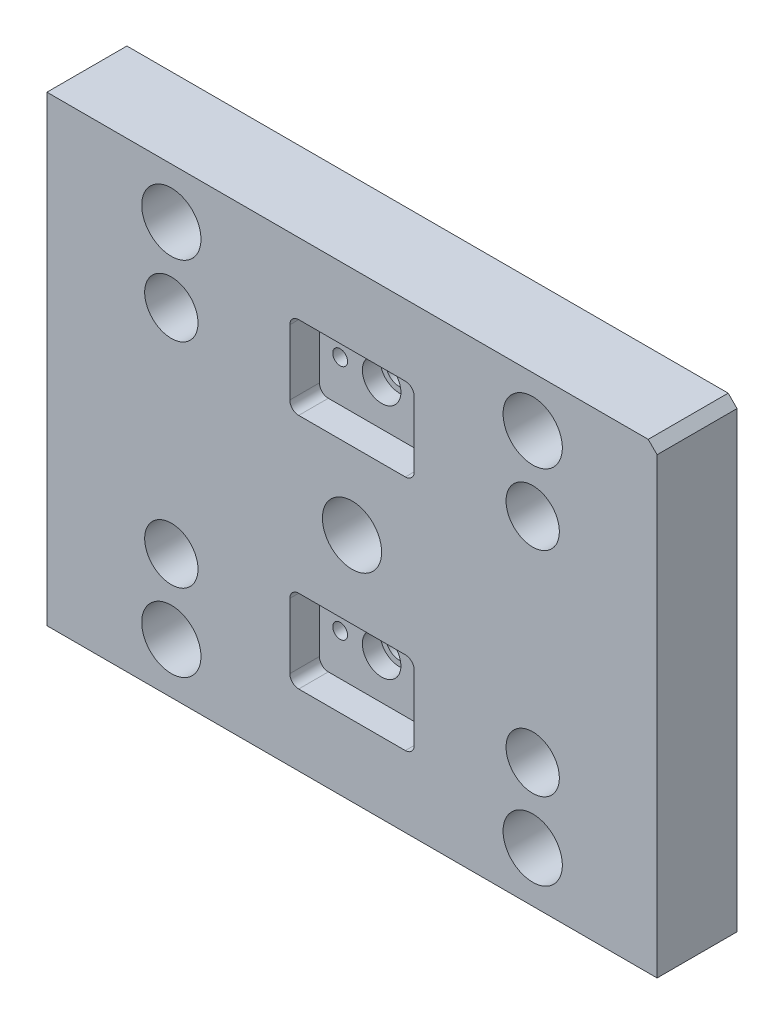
from build123d import *

# Parameters (mm, degrees)
ESQUISSE1_W                 = 206
ESQUISSE1_H                 = 156
EXTRUSION1_DEPTH            = 27
ESQUISSE3_R                 = 10
ESQUISSE3_R_2               = 5.25
ENL_V_MAT_EXTRU_1_DEPTH     = 132.992424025
ESQUISSE13_R                = 9
ENL_V_MAT_EXTRU_9_DEPTH     = 13
SYM_TRIE2_COPY_1_SKETCH_R   = 10
SYM_TRIE2_COPY_1_SKETCH_R_2 = 5.25
SYM_TRIE2_COPY_1_DEPTH      = 132.992424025
SYM_TRIE2_COPY_2_SKETCH_R   = 9
SYM_TRIE2_COPY_2_DEPTH      = 13
ESQUISSE10_W                = 42
ESQUISSE10_H                = 28
ENL_V_MAT_EXTRU_6_DEPTH     = 10
CONG_1_R                    = 3
ESQUISSE17_R                = 10
ENL_V_MAT_EXTRU_12_DEPTH    = 132.992424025
CHANFREIN_D_SIZE            = 3
CONG_1_OF_SYM_TRIE3_R       = 3
ESQUISSE18_R                = 4.6
ENL_V_MAT_EXTRU_13_DEPTH    = 132.992424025
ESQUISSE19_R                = 6.5
ENL_V_MAT_EXTRU_14_DEPTH    = 6
TROU_TARAUD_M61_AT_2_COUNT  = 2
TROU_TARAUD_M61_AT_2_PITCH  = 28


with BuildPart() as part:
    # Esquisse1 → Extrusion1 (new body)
    with BuildSketch(Plane.XY):
        Rectangle(ESQUISSE1_W, ESQUISSE1_H)
    extrude(amount=EXTRUSION1_DEPTH)

    # Esquisse3 → Enl_v. mat.-Extru.1 (cut, through all)
    with BuildSketch(Plane.XY.offset(27)):
        with Locations((-61, 61)):
            Circle(ESQUISSE3_R)
        with Locations((-61, 36)):
            Circle(ESQUISSE3_R_2)
    enl_v_mat_extru_1 = extrude(amount=-ENL_V_MAT_EXTRU_1_DEPTH, mode=Mode.SUBTRACT)

    # Esquisse13 → Enl_v. mat.-Extru.9 (cut)
    with BuildSketch(Plane.XY.offset(27)):
        with Locations((-61, 36)):
            Circle(ESQUISSE13_R)
    enl_v_mat_extru_9 = extrude(amount=-ENL_V_MAT_EXTRU_9_DEPTH, mode=Mode.SUBTRACT)

    # Sym_trie1: Enl_v. mat.-Extru.1, Enl_v. mat.-Extru.9 across plane
    add(enl_v_mat_extru_1.mirror(Plane(origin=(0, 0, 0), x_dir=(0, 0, 1), z_dir=(1, 0, 0))), mode=Mode.SUBTRACT)
    add(enl_v_mat_extru_9.mirror(Plane(origin=(0, 0, 0), x_dir=(0, 0, 1), z_dir=(1, 0, 0))), mode=Mode.SUBTRACT)

    # Sym_trie2: Enl_v. mat.-Extru.1, Enl_v. mat.-Extru.9 across plane
    add(enl_v_mat_extru_1.mirror(Plane.ZX), mode=Mode.SUBTRACT)
    add(enl_v_mat_extru_9.mirror(Plane.ZX), mode=Mode.SUBTRACT)

    # Sym_trie2 copy 1 sketch → Sym_trie2 copy 1 (cut, through all)
    with BuildSketch(Plane(origin=(0, 0, 27), x_dir=(-1, 0, 0), z_dir=(0, 0, 1))):
        with Locations((-61, 61)):
            Circle(SYM_TRIE2_COPY_1_SKETCH_R)
        with Locations((-61, 36)):
            Circle(SYM_TRIE2_COPY_1_SKETCH_R_2)
    extrude(amount=-SYM_TRIE2_COPY_1_DEPTH, mode=Mode.SUBTRACT)

    # Sym_trie2 copy 2 sketch → Sym_trie2 copy 2 (cut)
    with BuildSketch(Plane(origin=(0, 0, 27), x_dir=(-1, 0, 0), z_dir=(0, 0, 1))):
        with Locations((-61, 36)):
            Circle(SYM_TRIE2_COPY_2_SKETCH_R)
    extrude(amount=-SYM_TRIE2_COPY_2_DEPTH, mode=Mode.SUBTRACT)

    # Esquisse10 → Enl_v. mat.-Extru.6 (cut)
    with BuildSketch(Plane.XY.offset(27)):
        with Locations((0, -40)):
            Rectangle(ESQUISSE10_W, ESQUISSE10_H)
    enl_v_mat_extru_6 = extrude(amount=-ENL_V_MAT_EXTRU_6_DEPTH, mode=Mode.SUBTRACT)

    # Cong_1
    cong_1_edges = [part.edges().sort_by_distance(p)[0] for p in [
        (-21, -54, 22),
        (-21, -26, 22),
        (21, -26, 22),
        (21, -54, 22),
    ]]
    fillet(cong_1_edges, radius=CONG_1_R)

    # Esquisse17 → Enl_v. mat.-Extru.12 (cut, through all)
    with BuildSketch(Plane.XY.offset(27)):
        Circle(ESQUISSE17_R)
    extrude(amount=-ENL_V_MAT_EXTRU_12_DEPTH, mode=Mode.SUBTRACT)

    # Chanfrein_D
    chanfrein_d_edges = [part.edges().sort_by_distance(p)[0] for p in [
        (103, 78, 13.5),
    ]]
    chamfer(chanfrein_d_edges, length=CHANFREIN_D_SIZE)

    # Sym_trie3: Enl_v. mat.-Extru.6 across plane
    add(enl_v_mat_extru_6.mirror(Plane.ZX), mode=Mode.SUBTRACT)

    # Cong_1 of Sym_trie3
    cong_1_of_sym_trie3_edges = [part.edges().sort_by_distance(p)[0] for p in [
        (-21, 54, 22),
        (-21, 26, 22),
        (21, 26, 22),
        (21, 54, 22),
    ]]
    fillet(cong_1_of_sym_trie3_edges, radius=CONG_1_OF_SYM_TRIE3_R)

    # Esquisse18 → Enl_v. mat.-Extru.13 (cut, through all)
    with BuildSketch(Plane(origin=(0, 0, 0), x_dir=(-1, 0, 0), z_dir=(0, 0, -1))):
        with Locations((0, -40)):
            Circle(ESQUISSE18_R)
        with Locations((0, 40)):
            Circle(ESQUISSE18_R)
    extrude(amount=-ENL_V_MAT_EXTRU_13_DEPTH, mode=Mode.SUBTRACT)

    # Esquisse19 → Enl_v. mat.-Extru.14 (cut)
    with BuildSketch(Plane.XY.offset(17)):
        with Locations((0, 40)):
            Circle(ESQUISSE19_R)
        with Locations((0, -40)):
            Circle(ESQUISSE19_R)
    extrude(amount=-ENL_V_MAT_EXTRU_14_DEPTH, mode=Mode.SUBTRACT)

    # Esquisse21 → Trou taraud_ M61 (revolve, cut)
    with BuildSketch(Plane(origin=(14, 40, 17), x_dir=(0, -1, 0), z_dir=(1, 0, 0))):
        Polygon((0, 0), (0, 18.502151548), (2.5, 17), (2.5, 0), align=None)
    trou_taraud_m61 = revolve(axis=Axis((14, 40, 23.35), (0, 0, -1)), mode=Mode.SUBTRACT)

    # Trou taraud_ M61 at 2: Trou taraud_ M61 ×2
    with Locations(*[(-i * TROU_TARAUD_M61_AT_2_PITCH, 0, 0) for i in range(1, TROU_TARAUD_M61_AT_2_COUNT)]):
        add(trou_taraud_m61, mode=Mode.SUBTRACT)

    # Sym_trie4: Trou taraud_ M61 across plane
    add(trou_taraud_m61.mirror(Plane.ZX), mode=Mode.SUBTRACT)

    # Sym_trie4 copy 1 sketch → Sym_trie4 copy 1 (revolve, cut)
    with BuildSketch(Plane(origin=(-14, -40, 17), x_dir=(0, 1, 0), z_dir=(1, 0, 0))):
        Polygon((0, 0), (0, -18.502151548), (2.5, -17), (2.5, 0), align=None)
    revolve(axis=Axis((-14, -40, 23.35), (0, 0, 1)), mode=Mode.SUBTRACT)


solid = part.part
